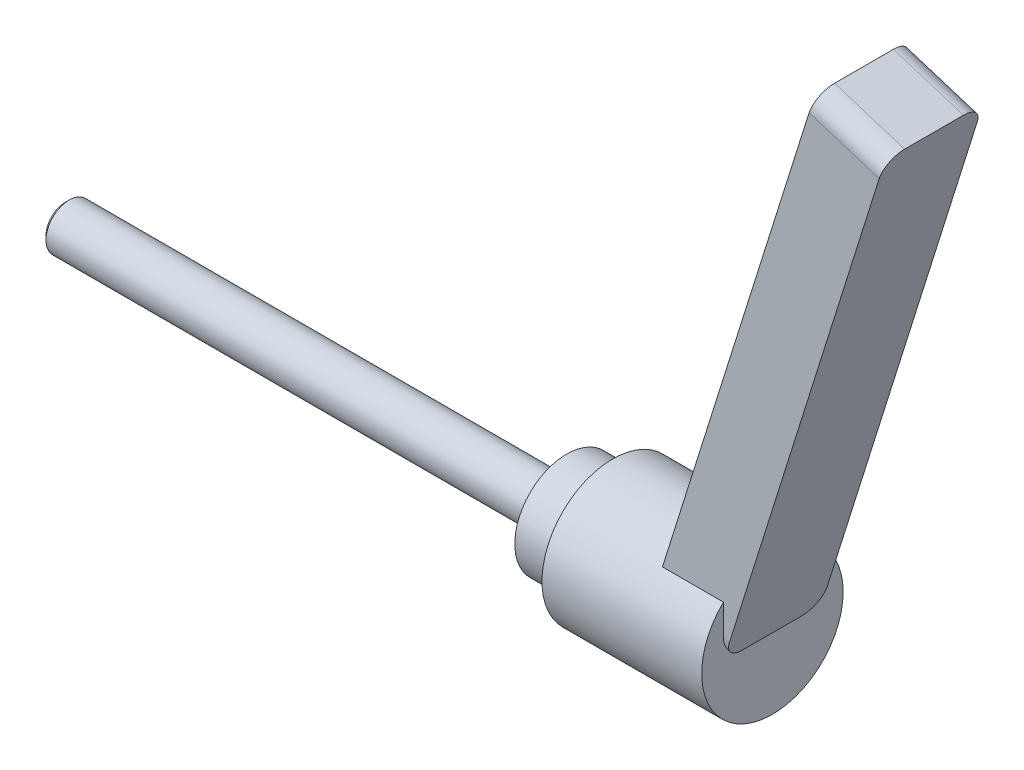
ISO-10303-21;
HEADER;
FILE_DESCRIPTION(('STEP AP214'),'2;1');
FILE_NAME('part.step','',(''),(''),'','','');
FILE_SCHEMA(('AUTOMOTIVE_DESIGN { 1 0 10303 214 1 1 1 1 }'));
ENDSEC;
DATA;
#1=APPLICATION_CONTEXT('core data for automotive mechanical design processes');
#2=APPLICATION_PROTOCOL_DEFINITION('international standard','automotive_design',2000,#1);
#3=PRODUCT_CONTEXT('',#1,'mechanical');
#4=PRODUCT('Part','Part','',(#3));
#5=PRODUCT_RELATED_PRODUCT_CATEGORY('part','',(#4));
#6=PRODUCT_DEFINITION_FORMATION('','',#4);
#7=PRODUCT_DEFINITION_CONTEXT('part definition',#1,'design');
#8=PRODUCT_DEFINITION('design','',#6,#7);
#9=PRODUCT_DEFINITION_SHAPE('','',#8);
#10=(LENGTH_UNIT() NAMED_UNIT(*) SI_UNIT(.MILLI.,.METRE.));
#11=(NAMED_UNIT(*) PLANE_ANGLE_UNIT() SI_UNIT($,.RADIAN.));
#12=(NAMED_UNIT(*) SI_UNIT($,.STERADIAN.) SOLID_ANGLE_UNIT());
#13=UNCERTAINTY_MEASURE_WITH_UNIT(LENGTH_MEASURE(1.E-05),#10,'distance_accuracy_value','');
#14=(GEOMETRIC_REPRESENTATION_CONTEXT(3) GLOBAL_UNCERTAINTY_ASSIGNED_CONTEXT((#13)) GLOBAL_UNIT_ASSIGNED_CONTEXT((#10,
#11,#12)) REPRESENTATION_CONTEXT('',''));
#15=CARTESIAN_POINT('',(0.,0.,0.));
#16=DIRECTION('',(0.,0.,1.));
#17=DIRECTION('',(1.,0.,0.));
#18=AXIS2_PLACEMENT_3D('',#15,#16,#17);
#19=CARTESIAN_POINT('',(47.6250000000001,66.6750000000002,-3.80999999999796));
#20=DIRECTION('',(0.299826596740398,0.953993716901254,0.));
#21=DIRECTION('',(-0.953993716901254,0.299826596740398,0.));
#22=AXIS2_PLACEMENT_3D('',#19,#20,#21);
#23=PLANE('',#22);
#24=DIRECTION('',(0.,0.,1.));
#25=VECTOR('',#24,1.);
#26=CARTESIAN_POINT('',(47.6250000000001,66.6750000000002,0.));
#27=LINE('',#26,#25);
#28=CARTESIAN_POINT('',(47.6250000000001,66.6750000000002,-3.80999999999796));
#29=VERTEX_POINT('',#28);
#30=CARTESIAN_POINT('',(47.6250000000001,66.6750000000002,3.80999999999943));
#31=VERTEX_POINT('',#30);
#32=EDGE_CURVE('E87',#29,#31,#27,.T.);
#33=ORIENTED_EDGE('',*,*,#32,.F.);
#34=DIRECTION('',(-0.953993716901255,0.299826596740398,0.));
#35=VECTOR('',#34,1.);
#36=CARTESIAN_POINT('',(47.6250000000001,66.6750000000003,-3.80999999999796));
#37=LINE('',#36,#35);
#38=CARTESIAN_POINT('',(38.5382098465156,69.5308483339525,-3.80999999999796));
#39=VERTEX_POINT('',#38);
#40=EDGE_CURVE('E93',#39,#29,#37,.F.);
#41=ORIENTED_EDGE('',*,*,#40,.F.);
#42=DIRECTION('',(0.,0.,1.));
#43=VECTOR('',#42,1.);
#44=CARTESIAN_POINT('',(38.5382098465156,69.5308483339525,6.35000000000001));
#45=LINE('',#44,#43);
#46=CARTESIAN_POINT('',(38.5382098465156,69.5308483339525,3.80999999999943));
#47=VERTEX_POINT('',#46);
#48=EDGE_CURVE('E90',#39,#47,#45,.T.);
#49=ORIENTED_EDGE('',*,*,#48,.T.);
#50=DIRECTION('',(-0.953993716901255,0.299826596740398,0.));
#51=VECTOR('',#50,1.);
#52=CARTESIAN_POINT('',(47.625,66.6750000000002,3.80999999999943));
#53=LINE('',#52,#51);
#54=EDGE_CURVE('E84',#31,#47,#53,.T.);
#55=ORIENTED_EDGE('',*,*,#54,.F.);
#56=EDGE_LOOP('',(#33,#41,#49,#55));
#57=FACE_BOUND('',#56,.T.);
#58=ADVANCED_FACE('F16',(#57),#23,.T.);
#59=CARTESIAN_POINT('',(46.8634404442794,64.251855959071,3.80999999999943));
#60=DIRECTION('',(-0.953993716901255,0.299826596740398,0.));
#61=DIRECTION('',(-0.299826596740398,-0.953993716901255,0.));
#62=AXIS2_PLACEMENT_3D('',#59,#60,#61);
#63=CYLINDRICAL_SURFACE('',#62,2.54);
#64=CARTESIAN_POINT('',(46.8634404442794,64.251855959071,3.80999999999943));
#65=DIRECTION('',(-0.953993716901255,0.299826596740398,0.));
#66=DIRECTION('',(-0.299826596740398,-0.953993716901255,0.));
#67=AXIS2_PLACEMENT_3D('',#64,#65,#66);
#68=CIRCLE('',#67,2.54);
#69=CARTESIAN_POINT('',(46.8634404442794,64.251855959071,6.35000000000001));
#70=VERTEX_POINT('',#69);
#71=EDGE_CURVE('E19',#31,#70,#68,.F.);
#72=ORIENTED_EDGE('',*,*,#71,.F.);
#73=ORIENTED_EDGE('',*,*,#54,.T.);
#74=CARTESIAN_POINT('',(37.776650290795,67.1077042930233,3.80999999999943));
#75=DIRECTION('',(-0.953993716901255,0.299826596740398,0.));
#76=DIRECTION('',(-0.299826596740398,-0.953993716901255,0.));
#77=AXIS2_PLACEMENT_3D('',#74,#75,#76);
#78=CIRCLE('',#77,2.54);
#79=CARTESIAN_POINT('',(37.776650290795,67.1077042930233,6.35000000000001));
#80=VERTEX_POINT('',#79);
#81=EDGE_CURVE('E161',#47,#80,#78,.F.);
#82=ORIENTED_EDGE('',*,*,#81,.T.);
#83=DIRECTION('',(-0.953993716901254,0.299826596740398,0.));
#84=VECTOR('',#83,1.);
#85=CARTESIAN_POINT('',(46.8634404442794,64.251855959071,6.35000000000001));
#86=LINE('',#85,#84);
#87=EDGE_CURVE('E99',#70,#80,#86,.T.);
#88=ORIENTED_EDGE('',*,*,#87,.F.);
#89=EDGE_LOOP('',(#72,#73,#82,#88));
#90=FACE_BOUND('',#89,.T.);
#91=ADVANCED_FACE('F97',(#90),#63,.T.);
#92=CARTESIAN_POINT('',(46.8634404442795,64.2518559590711,-3.80999999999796));
#93=DIRECTION('',(-0.953993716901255,0.299826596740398,0.));
#94=DIRECTION('',(-0.299826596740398,-0.953993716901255,0.));
#95=AXIS2_PLACEMENT_3D('',#92,#93,#94);
#96=CYLINDRICAL_SURFACE('',#95,2.54);
#97=CARTESIAN_POINT('',(46.8634404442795,64.2518559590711,-3.80999999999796));
#98=DIRECTION('',(-0.953993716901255,0.299826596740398,0.));
#99=DIRECTION('',(-0.299826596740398,-0.953993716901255,0.));
#100=AXIS2_PLACEMENT_3D('',#97,#98,#99);
#101=CIRCLE('',#100,2.54);
#102=CARTESIAN_POINT('',(46.8634404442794,64.251855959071,-6.34999999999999));
#103=VERTEX_POINT('',#102);
#104=EDGE_CURVE('E106',#103,#29,#101,.F.);
#105=ORIENTED_EDGE('',*,*,#104,.F.);
#106=DIRECTION('',(0.953993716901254,-0.299826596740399,0.));
#107=VECTOR('',#106,1.);
#108=CARTESIAN_POINT('',(37.7766502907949,67.1077042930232,-6.34999999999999));
#109=LINE('',#108,#107);
#110=CARTESIAN_POINT('',(37.776650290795,67.1077042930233,-6.34999999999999));
#111=VERTEX_POINT('',#110);
#112=EDGE_CURVE('E124',#111,#103,#109,.T.);
#113=ORIENTED_EDGE('',*,*,#112,.F.);
#114=CARTESIAN_POINT('',(37.776650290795,67.1077042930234,-3.80999999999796));
#115=DIRECTION('',(-0.953993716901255,0.299826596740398,0.));
#116=DIRECTION('',(-0.299826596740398,-0.953993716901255,0.));
#117=AXIS2_PLACEMENT_3D('',#114,#115,#116);
#118=CIRCLE('',#117,2.54);
#119=EDGE_CURVE('E128',#111,#39,#118,.F.);
#120=ORIENTED_EDGE('',*,*,#119,.T.);
#121=ORIENTED_EDGE('',*,*,#40,.T.);
#122=EDGE_LOOP('',(#105,#113,#120,#121));
#123=FACE_BOUND('',#122,.T.);
#124=ADVANCED_FACE('F175',(#123),#96,.T.);
#125=CARTESIAN_POINT('',(27.4315595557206,2.42314404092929,-3.80999999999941));
#126=DIRECTION('',(-0.953993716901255,0.299826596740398,0.));
#127=DIRECTION('',(-0.299826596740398,-0.953993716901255,0.));
#128=AXIS2_PLACEMENT_3D('',#125,#126,#127);
#129=CYLINDRICAL_SURFACE('',#128,2.54);
#130=DIRECTION('',(-0.953993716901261,0.299826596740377,0.));
#131=VECTOR('',#130,1.);
#132=CARTESIAN_POINT('',(27.4315595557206,2.42314404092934,-6.34999999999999));
#133=LINE('',#132,#131);
#134=CARTESIAN_POINT('',(27.4315595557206,2.42314404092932,-6.34999999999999));
#135=VERTEX_POINT('',#134);
#136=CARTESIAN_POINT('',(26.67,2.66249132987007,-6.3499999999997));
#137=VERTEX_POINT('',#136);
#138=EDGE_CURVE('E115',#135,#137,#133,.T.);
#139=ORIENTED_EDGE('',*,*,#138,.F.);
#140=CARTESIAN_POINT('',(27.4315595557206,2.42314404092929,-3.80999999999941));
#141=DIRECTION('',(-0.953993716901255,0.299826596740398,0.));
#142=DIRECTION('',(-0.299826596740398,-0.953993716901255,0.));
#143=AXIS2_PLACEMENT_3D('',#140,#141,#142);
#144=CIRCLE('',#143,2.54);
#145=CARTESIAN_POINT('',(26.67,0.,-3.80999999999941));
#146=VERTEX_POINT('',#145);
#147=EDGE_CURVE('E103',#146,#135,#144,.F.);
#148=ORIENTED_EDGE('',*,*,#147,.F.);
#149=CARTESIAN_POINT('',(26.67,2.66249132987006,-3.80999999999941));
#150=DIRECTION('',(1.,0.,0.));
#151=DIRECTION('',(0.,1.,0.));
#152=AXIS2_PLACEMENT_3D('',#149,#150,#151);
#153=ELLIPSE('',#152,2.66249132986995,2.54);
#154=EDGE_CURVE('E158',#137,#146,#153,.F.);
#155=ORIENTED_EDGE('',*,*,#154,.F.);
#156=EDGE_LOOP('',(#139,#148,#155));
#157=FACE_BOUND('',#156,.T.);
#158=ADVANCED_FACE('F170',(#157),#129,.T.);
#159=CARTESIAN_POINT('',(37.1475,33.3375000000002,0.));
#160=DIRECTION('',(0.953993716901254,-0.299826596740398,0.));
#161=DIRECTION('',(0.299826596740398,0.953993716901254,0.));
#162=AXIS2_PLACEMENT_3D('',#159,#160,#161);
#163=PLANE('',#162);
#164=ORIENTED_EDGE('',*,*,#104,.T.);
#165=ORIENTED_EDGE('',*,*,#32,.T.);
#166=ORIENTED_EDGE('',*,*,#71,.T.);
#167=DIRECTION('',(0.299826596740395,0.953993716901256,0.));
#168=VECTOR('',#167,1.);
#169=CARTESIAN_POINT('',(27.4315595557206,2.42314404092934,6.35000000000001));
#170=LINE('',#169,#168);
#171=CARTESIAN_POINT('',(27.4315595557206,2.42314404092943,6.35000000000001));
#172=VERTEX_POINT('',#171);
#173=EDGE_CURVE('E121',#172,#70,#170,.T.);
#174=ORIENTED_EDGE('',*,*,#173,.F.);
#175=CARTESIAN_POINT('',(27.4315595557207,2.42314404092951,3.80999999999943));
#176=DIRECTION('',(-0.953993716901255,0.299826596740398,0.));
#177=DIRECTION('',(-0.299826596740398,-0.953993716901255,0.));
#178=AXIS2_PLACEMENT_3D('',#175,#176,#177);
#179=CIRCLE('',#178,2.54);
#180=CARTESIAN_POINT('',(26.67,2.19659360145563E-13,3.80999999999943));
#181=VERTEX_POINT('',#180);
#182=EDGE_CURVE('E107',#181,#172,#179,.T.);
#183=ORIENTED_EDGE('',*,*,#182,.F.);
#184=DIRECTION('',(0.,0.,-1.));
#185=VECTOR('',#184,1.);
#186=CARTESIAN_POINT('',(26.67,0.,0.));
#187=LINE('',#186,#185);
#188=EDGE_CURVE('E157',#146,#181,#187,.F.);
#189=ORIENTED_EDGE('',*,*,#188,.F.);
#190=ORIENTED_EDGE('',*,*,#147,.T.);
#191=DIRECTION('',(-0.299826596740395,-0.953993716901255,0.));
#192=VECTOR('',#191,1.);
#193=CARTESIAN_POINT('',(46.8634404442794,64.2518559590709,-6.34999999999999));
#194=LINE('',#193,#192);
#195=EDGE_CURVE('E118',#103,#135,#194,.T.);
#196=ORIENTED_EDGE('',*,*,#195,.F.);
#197=EDGE_LOOP('',(#164,#165,#166,#174,#183,#189,#190,#196));
#198=FACE_BOUND('',#197,.T.);
#199=ADVANCED_FACE('F104',(#198),#163,.T.);
#200=CARTESIAN_POINT('',(27.4315595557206,2.42314404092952,3.80999999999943));
#201=DIRECTION('',(-0.953993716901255,0.299826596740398,0.));
#202=DIRECTION('',(-0.299826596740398,-0.953993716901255,0.));
#203=AXIS2_PLACEMENT_3D('',#200,#201,#202);
#204=CYLINDRICAL_SURFACE('',#203,2.54);
#205=ORIENTED_EDGE('',*,*,#182,.T.);
#206=DIRECTION('',(0.953993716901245,-0.299826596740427,0.));
#207=VECTOR('',#206,1.);
#208=CARTESIAN_POINT('',(26.67,2.66249132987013,6.35000000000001));
#209=LINE('',#208,#207);
#210=CARTESIAN_POINT('',(26.67,2.66249132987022,6.34999999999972));
#211=VERTEX_POINT('',#210);
#212=EDGE_CURVE('E109',#211,#172,#209,.T.);
#213=ORIENTED_EDGE('',*,*,#212,.F.);
#214=CARTESIAN_POINT('',(26.67,2.6624913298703,3.80999999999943));
#215=DIRECTION('',(1.,0.,0.));
#216=DIRECTION('',(0.,1.,0.));
#217=AXIS2_PLACEMENT_3D('',#214,#215,#216);
#218=ELLIPSE('',#217,2.66249132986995,2.54);
#219=EDGE_CURVE('E154',#181,#211,#218,.F.);
#220=ORIENTED_EDGE('',*,*,#219,.F.);
#221=EDGE_LOOP('',(#205,#213,#220));
#222=FACE_BOUND('',#221,.T.);
#223=ADVANCED_FACE('F185',(#222),#204,.T.);
#224=CARTESIAN_POINT('',(46.8634404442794,64.251855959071,6.35000000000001));
#225=DIRECTION('',(0.,0.,1.));
#226=DIRECTION('',(1.,0.,0.));
#227=AXIS2_PLACEMENT_3D('',#224,#225,#226);
#228=PLANE('',#227);
#229=DIRECTION('',(0.299826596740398,0.953993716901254,0.));
#230=VECTOR('',#229,1.);
#231=CARTESIAN_POINT('',(37.776650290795,67.1077042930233,6.35000000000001));
#232=LINE('',#231,#230);
#233=CARTESIAN_POINT('',(18.7645903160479,6.614786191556,6.35));
#234=VERTEX_POINT('',#233);
#235=EDGE_CURVE('E163',#80,#234,#232,.F.);
#236=ORIENTED_EDGE('',*,*,#235,.T.);
#237=DIRECTION('',(1.,0.,0.));
#238=VECTOR('',#237,1.);
#239=CARTESIAN_POINT('',(5.96899999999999,6.61478619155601,6.34999999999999));
#240=LINE('',#239,#238);
#241=CARTESIAN_POINT('',(26.67,6.614786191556,6.35));
#242=VERTEX_POINT('',#241);
#243=EDGE_CURVE('E153',#242,#234,#240,.F.);
#244=ORIENTED_EDGE('',*,*,#243,.F.);
#245=DIRECTION('',(0.,1.,0.));
#246=VECTOR('',#245,1.);
#247=CARTESIAN_POINT('',(26.67,9.16940000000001,6.35));
#248=LINE('',#247,#246);
#249=EDGE_CURVE('E117',#211,#242,#248,.T.);
#250=ORIENTED_EDGE('',*,*,#249,.F.);
#251=ORIENTED_EDGE('',*,*,#212,.T.);
#252=ORIENTED_EDGE('',*,*,#173,.T.);
#253=ORIENTED_EDGE('',*,*,#87,.T.);
#254=EDGE_LOOP('',(#236,#244,#250,#251,#252,#253));
#255=FACE_BOUND('',#254,.T.);
#256=ADVANCED_FACE('F181',(#255),#228,.T.);
#257=CARTESIAN_POINT('',(37.776650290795,67.1077042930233,6.35000000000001));
#258=DIRECTION('',(0.953993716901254,-0.299826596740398,0.));
#259=DIRECTION('',(0.299826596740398,0.953993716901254,0.));
#260=AXIS2_PLACEMENT_3D('',#257,#258,#259);
#261=PLANE('',#260);
#262=ORIENTED_EDGE('',*,*,#235,.F.);
#263=ORIENTED_EDGE('',*,*,#81,.F.);
#264=ORIENTED_EDGE('',*,*,#48,.F.);
#265=ORIENTED_EDGE('',*,*,#119,.F.);
#266=DIRECTION('',(0.299826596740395,0.953993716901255,0.));
#267=VECTOR('',#266,1.);
#268=CARTESIAN_POINT('',(18.7645903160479,6.61478619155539,-6.34999999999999));
#269=LINE('',#268,#267);
#270=CARTESIAN_POINT('',(18.7645903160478,6.61478619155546,-6.35000000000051));
#271=VERTEX_POINT('',#270);
#272=EDGE_CURVE('E127',#271,#111,#269,.T.);
#273=ORIENTED_EDGE('',*,*,#272,.F.);
#274=CARTESIAN_POINT('',(16.6856575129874,0.,0.));
#275=DIRECTION('',(0.953993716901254,-0.299826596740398,0.));
#276=DIRECTION('',(0.299826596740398,0.953993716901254,0.));
#277=AXIS2_PLACEMENT_3D('',#274,#275,#276);
#278=ELLIPSE('',#277,9.61159370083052,9.16939999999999);
#279=EDGE_CURVE('E150',#234,#271,#278,.F.);
#280=ORIENTED_EDGE('',*,*,#279,.F.);
#281=EDGE_LOOP('',(#262,#263,#264,#265,#273,#280));
#282=FACE_BOUND('',#281,.T.);
#283=ADVANCED_FACE('F178',(#282),#261,.F.);
#284=CARTESIAN_POINT('',(27.4315595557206,2.42314404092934,-6.34999999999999));
#285=DIRECTION('',(0.,0.,-1.));
#286=DIRECTION('',(-1.,0.,0.));
#287=AXIS2_PLACEMENT_3D('',#284,#285,#286);
#288=PLANE('',#287);
#289=ORIENTED_EDGE('',*,*,#195,.T.);
#290=ORIENTED_EDGE('',*,*,#138,.T.);
#291=DIRECTION('',(0.,1.,0.));
#292=VECTOR('',#291,1.);
#293=CARTESIAN_POINT('',(26.67,9.16940000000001,-6.34999999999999));
#294=LINE('',#293,#292);
#295=CARTESIAN_POINT('',(26.67,6.61478619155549,-6.35000000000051));
#296=VERTEX_POINT('',#295);
#297=EDGE_CURVE('E34',#296,#137,#294,.F.);
#298=ORIENTED_EDGE('',*,*,#297,.F.);
#299=DIRECTION('',(1.,0.,0.));
#300=VECTOR('',#299,1.);
#301=CARTESIAN_POINT('',(5.96899999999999,6.61478619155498,-6.35000000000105));
#302=LINE('',#301,#300);
#303=EDGE_CURVE('E149',#271,#296,#302,.T.);
#304=ORIENTED_EDGE('',*,*,#303,.F.);
#305=ORIENTED_EDGE('',*,*,#272,.T.);
#306=ORIENTED_EDGE('',*,*,#112,.T.);
#307=EDGE_LOOP('',(#289,#290,#298,#304,#305,#306));
#308=FACE_BOUND('',#307,.T.);
#309=ADVANCED_FACE('F171',(#308),#288,.T.);
#310=CARTESIAN_POINT('',(26.67,9.16940000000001,0.));
#311=DIRECTION('',(1.,0.,0.));
#312=DIRECTION('',(0.,0.,-1.));
#313=AXIS2_PLACEMENT_3D('',#310,#311,#312);
#314=PLANE('',#313);
#315=ORIENTED_EDGE('',*,*,#188,.T.);
#316=ORIENTED_EDGE('',*,*,#219,.T.);
#317=ORIENTED_EDGE('',*,*,#249,.T.);
#318=CARTESIAN_POINT('',(26.67,0.,0.));
#319=DIRECTION('',(1.,0.,0.));
#320=DIRECTION('',(0.,0.,-1.));
#321=AXIS2_PLACEMENT_3D('',#318,#319,#320);
#322=CIRCLE('',#321,9.16939999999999);
#323=EDGE_CURVE('E146',#296,#242,#322,.F.);
#324=ORIENTED_EDGE('',*,*,#323,.F.);
#325=ORIENTED_EDGE('',*,*,#297,.T.);
#326=ORIENTED_EDGE('',*,*,#154,.T.);
#327=EDGE_LOOP('',(#315,#316,#317,#324,#325,#326));
#328=FACE_BOUND('',#327,.T.);
#329=ADVANCED_FACE('F188',(#328),#314,.T.);
#330=CARTESIAN_POINT('',(5.96899999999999,0.,0.));
#331=DIRECTION('',(1.,0.,0.));
#332=DIRECTION('',(0.,0.,-1.));
#333=AXIS2_PLACEMENT_3D('',#330,#331,#332);
#334=CYLINDRICAL_SURFACE('',#333,9.16939999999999);
#335=ORIENTED_EDGE('',*,*,#303,.T.);
#336=ORIENTED_EDGE('',*,*,#323,.T.);
#337=ORIENTED_EDGE('',*,*,#243,.T.);
#338=ORIENTED_EDGE('',*,*,#279,.T.);
#339=EDGE_LOOP('',(#335,#336,#337,#338));
#340=FACE_BOUND('',#339,.T.);
#341=CARTESIAN_POINT('',(5.96899999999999,0.,0.));
#342=DIRECTION('',(1.,0.,0.));
#343=DIRECTION('',(0.,0.,-1.));
#344=AXIS2_PLACEMENT_3D('',#341,#342,#343);
#345=CIRCLE('',#344,9.16939999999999);
#346=CARTESIAN_POINT('',(5.96899999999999,0.,-9.16939999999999));
#347=VERTEX_POINT('',#346);
#348=EDGE_CURVE('E143',#347,#347,#345,.T.);
#349=ORIENTED_EDGE('',*,*,#348,.T.);
#350=EDGE_LOOP('',(#349));
#351=FACE_BOUND('',#350,.T.);
#352=ADVANCED_FACE('F198',(#340,#351),#334,.T.);
#353=CARTESIAN_POINT('',(5.96899999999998,0.,0.));
#354=DIRECTION('',(1.,0.,0.));
#355=DIRECTION('',(0.,0.,-1.));
#356=AXIS2_PLACEMENT_3D('',#353,#354,#355);
#357=PLANE('',#356);
#358=CARTESIAN_POINT('',(5.96899999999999,0.,0.));
#359=DIRECTION('',(1.,0.,0.));
#360=DIRECTION('',(0.,0.,-1.));
#361=AXIS2_PLACEMENT_3D('',#358,#359,#360);
#362=CIRCLE('',#361,6.731);
#363=CARTESIAN_POINT('',(5.96899999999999,0.,-6.73099999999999));
#364=VERTEX_POINT('',#363);
#365=EDGE_CURVE('E140',#364,#364,#362,.F.);
#366=ORIENTED_EDGE('',*,*,#365,.F.);
#367=EDGE_LOOP('',(#366));
#368=FACE_BOUND('',#367,.T.);
#369=ORIENTED_EDGE('',*,*,#348,.F.);
#370=EDGE_LOOP('',(#369));
#371=FACE_BOUND('',#370,.T.);
#372=ADVANCED_FACE('F203',(#368,#371),#357,.F.);
#373=CARTESIAN_POINT('',(0.,0.,0.));
#374=DIRECTION('',(1.,0.,0.));
#375=DIRECTION('',(0.,0.,-1.));
#376=AXIS2_PLACEMENT_3D('',#373,#374,#375);
#377=CYLINDRICAL_SURFACE('',#376,6.731);
#378=CARTESIAN_POINT('',(0.,0.,0.));
#379=DIRECTION('',(1.,0.,0.));
#380=DIRECTION('',(0.,0.,-1.));
#381=AXIS2_PLACEMENT_3D('',#378,#379,#380);
#382=CIRCLE('',#381,6.731);
#383=CARTESIAN_POINT('',(0.,0.,-6.731));
#384=VERTEX_POINT('',#383);
#385=EDGE_CURVE('E137',#384,#384,#382,.T.);
#386=ORIENTED_EDGE('',*,*,#385,.T.);
#387=EDGE_LOOP('',(#386));
#388=FACE_BOUND('',#387,.T.);
#389=ORIENTED_EDGE('',*,*,#365,.T.);
#390=EDGE_LOOP('',(#389));
#391=FACE_BOUND('',#390,.T.);
#392=ADVANCED_FACE('F208',(#388,#391),#377,.T.);
#393=CARTESIAN_POINT('',(-65.,0.,0.));
#394=DIRECTION('',(1.,0.,0.));
#395=DIRECTION('',(0.,0.,-1.));
#396=AXIS2_PLACEMENT_3D('',#393,#394,#395);
#397=PLANE('',#396);
#398=CARTESIAN_POINT('',(-65.0000000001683,0.,0.));
#399=DIRECTION('',(1.,0.,0.));
#400=DIRECTION('',(0.,0.,-1.));
#401=AXIS2_PLACEMENT_3D('',#398,#399,#400);
#402=CIRCLE('',#401,2.50000000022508);
#403=CARTESIAN_POINT('',(-65.0000000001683,0.,-2.5000000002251));
#404=VERTEX_POINT('',#403);
#405=EDGE_CURVE('E134',#404,#404,#402,.T.);
#406=ORIENTED_EDGE('',*,*,#405,.F.);
#407=EDGE_LOOP('',(#406));
#408=FACE_BOUND('',#407,.T.);
#409=ADVANCED_FACE('F215',(#408),#397,.F.);
#410=CARTESIAN_POINT('',(0.,0.,0.));
#411=DIRECTION('',(1.,0.,0.));
#412=DIRECTION('',(0.,0.,-1.));
#413=AXIS2_PLACEMENT_3D('',#410,#411,#412);
#414=PLANE('',#413);
#415=CARTESIAN_POINT('',(0.,0.,0.));
#416=DIRECTION('',(-1.,0.,0.));
#417=DIRECTION('',(0.,0.,1.));
#418=AXIS2_PLACEMENT_3D('',#415,#416,#417);
#419=CIRCLE('',#418,3.);
#420=CARTESIAN_POINT('',(0.,0.,3.));
#421=VERTEX_POINT('',#420);
#422=EDGE_CURVE('E25',#421,#421,#419,.T.);
#423=ORIENTED_EDGE('',*,*,#422,.F.);
#424=EDGE_LOOP('',(#423));
#425=FACE_BOUND('',#424,.T.);
#426=ORIENTED_EDGE('',*,*,#385,.F.);
#427=EDGE_LOOP('',(#426));
#428=FACE_BOUND('',#427,.T.);
#429=ADVANCED_FACE('F227',(#425,#428),#414,.F.);
#430=CARTESIAN_POINT('',(-64.4999999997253,0.,0.));
#431=DIRECTION('',(1.,0.,0.));
#432=DIRECTION('',(0.,0.,-1.));
#433=AXIS2_PLACEMENT_3D('',#430,#431,#432);
#434=CONICAL_SURFACE('',#433,2.99999999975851,0.785398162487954);
#435=CARTESIAN_POINT('',(-64.5,0.,0.));
#436=DIRECTION('',(-1.,0.,0.));
#437=DIRECTION('',(0.,0.,1.));
#438=AXIS2_PLACEMENT_3D('',#435,#436,#437);
#439=CIRCLE('',#438,3.);
#440=CARTESIAN_POINT('',(-64.5,0.,2.99999999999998));
#441=VERTEX_POINT('',#440);
#442=EDGE_CURVE('E11',#441,#441,#439,.F.);
#443=ORIENTED_EDGE('',*,*,#442,.F.);
#444=EDGE_LOOP('',(#443));
#445=FACE_BOUND('',#444,.T.);
#446=ORIENTED_EDGE('',*,*,#405,.T.);
#447=EDGE_LOOP('',(#446));
#448=FACE_BOUND('',#447,.T.);
#449=ADVANCED_FACE('F221',(#445,#448),#434,.T.);
#450=CARTESIAN_POINT('',(0.,0.,0.));
#451=DIRECTION('',(-1.,0.,0.));
#452=DIRECTION('',(0.,0.,1.));
#453=AXIS2_PLACEMENT_3D('',#450,#451,#452);
#454=CYLINDRICAL_SURFACE('',#453,3.);
#455=ORIENTED_EDGE('',*,*,#442,.T.);
#456=EDGE_LOOP('',(#455));
#457=FACE_BOUND('',#456,.T.);
#458=ORIENTED_EDGE('',*,*,#422,.T.);
#459=EDGE_LOOP('',(#458));
#460=FACE_BOUND('',#459,.T.);
#461=ADVANCED_FACE('F219',(#457,#460),#454,.T.);
#462=CLOSED_SHELL('',(#58,#91,#124,#158,#199,#223,#256,#283,#309,#329,#352,#372,#392,#409,#429,
#449,#461));
#463=MANIFOLD_SOLID_BREP('B1',#462);
#464=ADVANCED_BREP_SHAPE_REPRESENTATION('',(#18,#463),#14);
#465=SHAPE_DEFINITION_REPRESENTATION(#9,#464);
ENDSEC;
END-ISO-10303-21;
